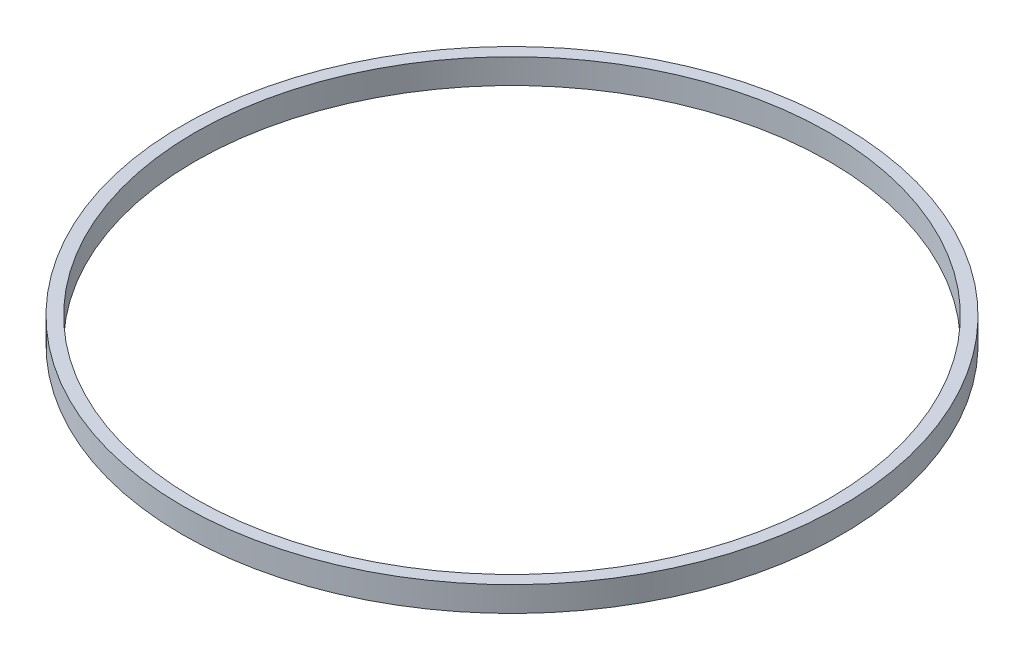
ISO-10303-21;
HEADER;
FILE_DESCRIPTION(('STEP AP214'),'2;1');
FILE_NAME('part.step','',(''),(''),'','','');
FILE_SCHEMA(('AUTOMOTIVE_DESIGN { 1 0 10303 214 1 1 1 1 }'));
ENDSEC;
DATA;
#1=APPLICATION_CONTEXT('core data for automotive mechanical design processes');
#2=APPLICATION_PROTOCOL_DEFINITION('international standard','automotive_design',2000,#1);
#3=PRODUCT_CONTEXT('',#1,'mechanical');
#4=PRODUCT('Part','Part','',(#3));
#5=PRODUCT_RELATED_PRODUCT_CATEGORY('part','',(#4));
#6=PRODUCT_DEFINITION_FORMATION('','',#4);
#7=PRODUCT_DEFINITION_CONTEXT('part definition',#1,'design');
#8=PRODUCT_DEFINITION('design','',#6,#7);
#9=PRODUCT_DEFINITION_SHAPE('','',#8);
#10=(LENGTH_UNIT() NAMED_UNIT(*) SI_UNIT(.MILLI.,.METRE.));
#11=(NAMED_UNIT(*) PLANE_ANGLE_UNIT() SI_UNIT($,.RADIAN.));
#12=(NAMED_UNIT(*) SI_UNIT($,.STERADIAN.) SOLID_ANGLE_UNIT());
#13=UNCERTAINTY_MEASURE_WITH_UNIT(LENGTH_MEASURE(1.E-05),#10,'distance_accuracy_value','');
#14=(GEOMETRIC_REPRESENTATION_CONTEXT(3) GLOBAL_UNCERTAINTY_ASSIGNED_CONTEXT((#13)) GLOBAL_UNIT_ASSIGNED_CONTEXT((#10,
#11,#12)) REPRESENTATION_CONTEXT('',''));
#15=CARTESIAN_POINT('',(0.,0.,0.));
#16=DIRECTION('',(0.,0.,1.));
#17=DIRECTION('',(1.,0.,0.));
#18=AXIS2_PLACEMENT_3D('',#15,#16,#17);
#19=CARTESIAN_POINT('',(0.,1.,0.));
#20=DIRECTION('',(0.,1.,0.));
#21=DIRECTION('',(0.,0.,1.));
#22=AXIS2_PLACEMENT_3D('',#19,#20,#21);
#23=PLANE('',#22);
#24=CARTESIAN_POINT('',(0.,1.,0.));
#25=DIRECTION('',(0.,1.,0.));
#26=DIRECTION('',(0.,0.,1.));
#27=AXIS2_PLACEMENT_3D('',#24,#25,#26);
#28=CIRCLE('',#27,13.2);
#29=CARTESIAN_POINT('',(0.,1.,13.2));
#30=VERTEX_POINT('',#29);
#31=EDGE_CURVE('E10',#30,#30,#28,.T.);
#32=ORIENTED_EDGE('',*,*,#31,.T.);
#33=EDGE_LOOP('',(#32));
#34=FACE_BOUND('',#33,.T.);
#35=CARTESIAN_POINT('',(0.,1.,0.));
#36=DIRECTION('',(0.,1.,0.));
#37=DIRECTION('',(0.,0.,1.));
#38=AXIS2_PLACEMENT_3D('',#35,#36,#37);
#39=CIRCLE('',#38,12.7);
#40=CARTESIAN_POINT('',(0.,1.,12.7));
#41=VERTEX_POINT('',#40);
#42=EDGE_CURVE('E56',#41,#41,#39,.T.);
#43=ORIENTED_EDGE('',*,*,#42,.F.);
#44=EDGE_LOOP('',(#43));
#45=FACE_BOUND('',#44,.T.);
#46=ADVANCED_FACE('F43',(#34,#45),#23,.T.);
#47=CARTESIAN_POINT('',(0.,0.,0.));
#48=DIRECTION('',(0.,1.,0.));
#49=DIRECTION('',(0.,0.,1.));
#50=AXIS2_PLACEMENT_3D('',#47,#48,#49);
#51=PLANE('',#50);
#52=CARTESIAN_POINT('',(0.,0.,0.));
#53=DIRECTION('',(0.,1.,0.));
#54=DIRECTION('',(0.,0.,1.));
#55=AXIS2_PLACEMENT_3D('',#52,#53,#54);
#56=CIRCLE('',#55,13.2);
#57=CARTESIAN_POINT('',(0.,0.,13.2));
#58=VERTEX_POINT('',#57);
#59=EDGE_CURVE('E47',#58,#58,#56,.T.);
#60=ORIENTED_EDGE('',*,*,#59,.F.);
#61=EDGE_LOOP('',(#60));
#62=FACE_BOUND('',#61,.T.);
#63=CARTESIAN_POINT('',(0.,0.,0.));
#64=DIRECTION('',(0.,1.,0.));
#65=DIRECTION('',(0.,0.,1.));
#66=AXIS2_PLACEMENT_3D('',#63,#64,#65);
#67=CIRCLE('',#66,12.7);
#68=CARTESIAN_POINT('',(0.,0.,12.7));
#69=VERTEX_POINT('',#68);
#70=EDGE_CURVE('E58',#69,#69,#67,.T.);
#71=ORIENTED_EDGE('',*,*,#70,.T.);
#72=EDGE_LOOP('',(#71));
#73=FACE_BOUND('',#72,.T.);
#74=ADVANCED_FACE('F70',(#62,#73),#51,.F.);
#75=CARTESIAN_POINT('',(0.,1.,0.));
#76=DIRECTION('',(0.,-1.,0.));
#77=DIRECTION('',(0.,0.,-1.));
#78=AXIS2_PLACEMENT_3D('',#75,#76,#77);
#79=CYLINDRICAL_SURFACE('',#78,13.2);
#80=ORIENTED_EDGE('',*,*,#31,.F.);
#81=EDGE_LOOP('',(#80));
#82=FACE_BOUND('',#81,.T.);
#83=ORIENTED_EDGE('',*,*,#59,.T.);
#84=EDGE_LOOP('',(#83));
#85=FACE_BOUND('',#84,.T.);
#86=ADVANCED_FACE('F45',(#82,#85),#79,.T.);
#87=CARTESIAN_POINT('',(0.,1.,0.));
#88=DIRECTION('',(0.,-1.,0.));
#89=DIRECTION('',(0.,0.,-1.));
#90=AXIS2_PLACEMENT_3D('',#87,#88,#89);
#91=CYLINDRICAL_SURFACE('',#90,12.7);
#92=ORIENTED_EDGE('',*,*,#42,.T.);
#93=EDGE_LOOP('',(#92));
#94=FACE_BOUND('',#93,.T.);
#95=ORIENTED_EDGE('',*,*,#70,.F.);
#96=EDGE_LOOP('',(#95));
#97=FACE_BOUND('',#96,.T.);
#98=ADVANCED_FACE('F66',(#94,#97),#91,.F.);
#99=CLOSED_SHELL('',(#46,#74,#86,#98));
#100=MANIFOLD_SOLID_BREP('B2',#99);
#101=ADVANCED_BREP_SHAPE_REPRESENTATION('',(#18,#100),#14);
#102=SHAPE_DEFINITION_REPRESENTATION(#9,#101);
ENDSEC;
END-ISO-10303-21;
